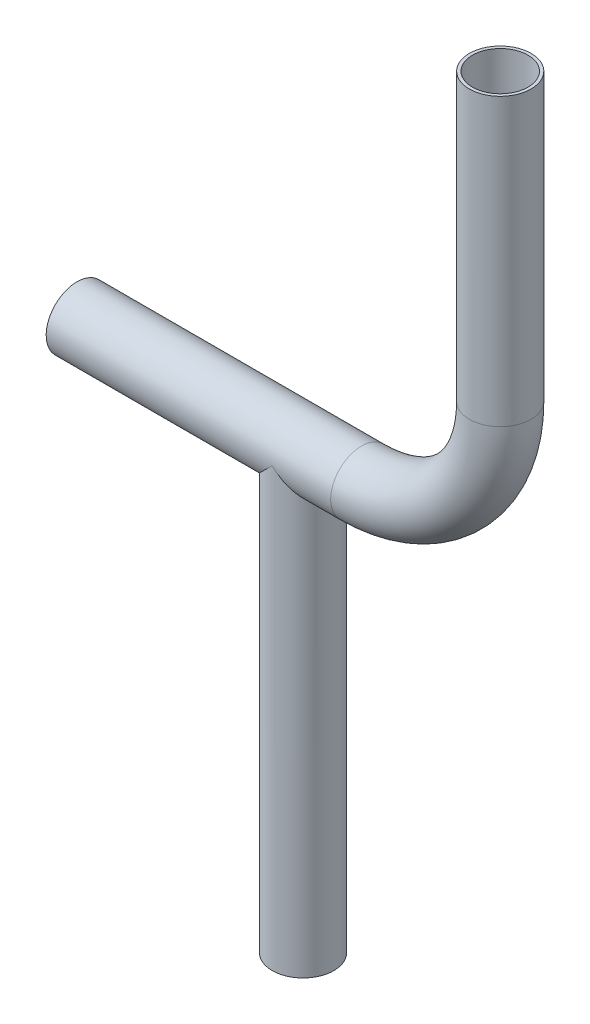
ISO-10303-21;
HEADER;
FILE_DESCRIPTION(('STEP AP214'),'2;1');
FILE_NAME('part.step','',(''),(''),'','','');
FILE_SCHEMA(('AUTOMOTIVE_DESIGN { 1 0 10303 214 1 1 1 1 }'));
ENDSEC;
DATA;
#1=APPLICATION_CONTEXT('core data for automotive mechanical design processes');
#2=APPLICATION_PROTOCOL_DEFINITION('international standard','automotive_design',2000,#1);
#3=PRODUCT_CONTEXT('',#1,'mechanical');
#4=PRODUCT('Part','Part','',(#3));
#5=PRODUCT_RELATED_PRODUCT_CATEGORY('part','',(#4));
#6=PRODUCT_DEFINITION_FORMATION('','',#4);
#7=PRODUCT_DEFINITION_CONTEXT('part definition',#1,'design');
#8=PRODUCT_DEFINITION('design','',#6,#7);
#9=PRODUCT_DEFINITION_SHAPE('','',#8);
#10=(LENGTH_UNIT() NAMED_UNIT(*) SI_UNIT(.MILLI.,.METRE.));
#11=(NAMED_UNIT(*) PLANE_ANGLE_UNIT() SI_UNIT($,.RADIAN.));
#12=(NAMED_UNIT(*) SI_UNIT($,.STERADIAN.) SOLID_ANGLE_UNIT());
#13=UNCERTAINTY_MEASURE_WITH_UNIT(LENGTH_MEASURE(1.E-05),#10,'distance_accuracy_value','');
#14=(GEOMETRIC_REPRESENTATION_CONTEXT(3) GLOBAL_UNCERTAINTY_ASSIGNED_CONTEXT((#13)) GLOBAL_UNIT_ASSIGNED_CONTEXT((#10,
#11,#12)) REPRESENTATION_CONTEXT('',''));
#15=CARTESIAN_POINT('',(0.,0.,0.));
#16=DIRECTION('',(0.,0.,1.));
#17=DIRECTION('',(1.,0.,0.));
#18=AXIS2_PLACEMENT_3D('',#15,#16,#17);
#19=CARTESIAN_POINT('',(56.8804723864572,425.366292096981,0.));
#20=DIRECTION('',(-1.,0.,0.));
#21=DIRECTION('',(0.,0.,1.));
#22=AXIS2_PLACEMENT_3D('',#19,#20,#21);
#23=CYLINDRICAL_SURFACE('',#22,30.);
#24=CARTESIAN_POINT('',(56.8804723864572,425.366292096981,0.));
#25=DIRECTION('',(1.,0.,0.));
#26=DIRECTION('',(0.,0.,-1.));
#27=AXIS2_PLACEMENT_3D('',#24,#25,#26);
#28=CIRCLE('',#27,30.);
#29=CARTESIAN_POINT('',(56.8804723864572,395.366292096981,0.));
#30=VERTEX_POINT('',#29);
#31=EDGE_CURVE('E77',#30,#30,#28,.T.);
#32=ORIENTED_EDGE('',*,*,#31,.F.);
#33=EDGE_LOOP('',(#32));
#34=FACE_BOUND('',#33,.T.);
#35=CARTESIAN_POINT('',(-219.813416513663,425.366292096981,0.));
#36=DIRECTION('',(1.,0.,0.));
#37=DIRECTION('',(0.,0.,-1.));
#38=AXIS2_PLACEMENT_3D('',#35,#36,#37);
#39=CIRCLE('',#38,30.);
#40=CARTESIAN_POINT('',(-219.813416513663,425.366292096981,-30.));
#41=VERTEX_POINT('',#40);
#42=EDGE_CURVE('E70',#41,#41,#39,.T.);
#43=ORIENTED_EDGE('',*,*,#42,.T.);
#44=EDGE_LOOP('',(#43));
#45=FACE_BOUND('',#44,.T.);
#46=CARTESIAN_POINT('',(0.,425.366292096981,0.));
#47=DIRECTION('',(-0.707106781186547,-0.707106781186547,0.));
#48=DIRECTION('',(0.707106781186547,-0.707106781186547,0.));
#49=AXIS2_PLACEMENT_3D('',#46,#47,#48);
#50=ELLIPSE('',#49,42.4264068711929,30.);
#51=CARTESIAN_POINT('',(0.,425.366292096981,30.));
#52=VERTEX_POINT('',#51);
#53=CARTESIAN_POINT('',(0.,425.366292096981,-30.));
#54=VERTEX_POINT('',#53);
#55=EDGE_CURVE('E62',#52,#54,#50,.F.);
#56=ORIENTED_EDGE('',*,*,#55,.T.);
#57=CARTESIAN_POINT('',(0.,425.366292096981,0.));
#58=DIRECTION('',(0.707106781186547,-0.707106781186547,0.));
#59=DIRECTION('',(-0.707106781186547,-0.707106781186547,0.));
#60=AXIS2_PLACEMENT_3D('',#57,#58,#59);
#61=ELLIPSE('',#60,42.4264068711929,30.);
#62=EDGE_CURVE('E60',#54,#52,#61,.F.);
#63=ORIENTED_EDGE('',*,*,#62,.T.);
#64=EDGE_LOOP('',(#56,#63));
#65=FACE_BOUND('',#64,.T.);
#66=ADVANCED_FACE('F46',(#34,#45,#65),#23,.T.);
#67=CARTESIAN_POINT('',(191.786393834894,560.272213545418,0.));
#68=DIRECTION('',(0.,1.,0.));
#69=DIRECTION('',(-1.,0.,0.));
#70=AXIS2_PLACEMENT_3D('',#67,#68,#69);
#71=CYLINDRICAL_SURFACE('',#70,30.);
#72=CARTESIAN_POINT('',(191.786393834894,560.272213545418,0.));
#73=DIRECTION('',(0.,1.,0.));
#74=DIRECTION('',(0.,0.,-1.));
#75=AXIS2_PLACEMENT_3D('',#72,#73,#74);
#76=CIRCLE('',#75,30.);
#77=CARTESIAN_POINT('',(221.786393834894,560.272213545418,0.));
#78=VERTEX_POINT('',#77);
#79=EDGE_CURVE('E85',#78,#78,#76,.T.);
#80=ORIENTED_EDGE('',*,*,#79,.T.);
#81=EDGE_LOOP('',(#80));
#82=FACE_BOUND('',#81,.T.);
#83=CARTESIAN_POINT('',(191.786393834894,838.539438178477,0.));
#84=DIRECTION('',(0.,1.,0.));
#85=DIRECTION('',(0.,0.,-1.));
#86=AXIS2_PLACEMENT_3D('',#83,#84,#85);
#87=CIRCLE('',#86,30.);
#88=CARTESIAN_POINT('',(191.786393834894,838.539438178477,-30.));
#89=VERTEX_POINT('',#88);
#90=EDGE_CURVE('E13',#89,#89,#87,.T.);
#91=ORIENTED_EDGE('',*,*,#90,.F.);
#92=EDGE_LOOP('',(#91));
#93=FACE_BOUND('',#92,.T.);
#94=ADVANCED_FACE('F48',(#82,#93),#71,.T.);
#95=CARTESIAN_POINT('',(191.786393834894,560.272213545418,0.));
#96=DIRECTION('',(0.,1.,0.));
#97=DIRECTION('',(-1.,0.,0.));
#98=AXIS2_PLACEMENT_3D('',#95,#96,#97);
#99=CYLINDRICAL_SURFACE('',#98,27.);
#100=CARTESIAN_POINT('',(191.786393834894,560.272213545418,0.));
#101=DIRECTION('',(0.,1.,0.));
#102=DIRECTION('',(0.,0.,-1.));
#103=AXIS2_PLACEMENT_3D('',#100,#101,#102);
#104=CIRCLE('',#103,27.);
#105=CARTESIAN_POINT('',(218.786393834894,560.272213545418,0.));
#106=VERTEX_POINT('',#105);
#107=EDGE_CURVE('E79',#106,#106,#104,.T.);
#108=ORIENTED_EDGE('',*,*,#107,.F.);
#109=EDGE_LOOP('',(#108));
#110=FACE_BOUND('',#109,.T.);
#111=CARTESIAN_POINT('',(191.786393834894,838.539438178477,0.));
#112=DIRECTION('',(0.,1.,0.));
#113=DIRECTION('',(0.,0.,-1.));
#114=AXIS2_PLACEMENT_3D('',#111,#112,#113);
#115=CIRCLE('',#114,27.);
#116=CARTESIAN_POINT('',(191.786393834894,838.539438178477,-27.));
#117=VERTEX_POINT('',#116);
#118=EDGE_CURVE('E54',#117,#117,#115,.T.);
#119=ORIENTED_EDGE('',*,*,#118,.T.);
#120=EDGE_LOOP('',(#119));
#121=FACE_BOUND('',#120,.T.);
#122=ADVANCED_FACE('F90',(#110,#121),#99,.F.);
#123=CARTESIAN_POINT('',(56.8804723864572,560.272213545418,0.));
#124=DIRECTION('',(0.,0.,1.));
#125=DIRECTION('',(1.,0.,0.));
#126=AXIS2_PLACEMENT_3D('',#123,#124,#125);
#127=TOROIDAL_SURFACE('',#126,134.905921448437,30.);
#128=CARTESIAN_POINT('',(56.8804723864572,560.272213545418,0.));
#129=DIRECTION('',(0.,0.,1.));
#130=DIRECTION('',(1.,0.,0.));
#131=AXIS2_PLACEMENT_3D('',#128,#129,#130);
#132=CIRCLE('',#131,164.905921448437);
#133=EDGE_CURVE('',#30,#78,#132,.T.);
#134=ORIENTED_EDGE('',*,*,#31,.T.);
#135=ORIENTED_EDGE('',*,*,#79,.F.);
#136=ORIENTED_EDGE('',*,*,#133,.T.);
#137=ORIENTED_EDGE('',*,*,#133,.F.);
#138=EDGE_LOOP('',(#134,#136,#135,#137));
#139=FACE_BOUND('',#138,.T.);
#140=ADVANCED_FACE('F106',(#139),#127,.T.);
#141=CARTESIAN_POINT('',(56.8804723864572,560.272213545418,0.));
#142=DIRECTION('',(0.,0.,1.));
#143=DIRECTION('',(1.,0.,0.));
#144=AXIS2_PLACEMENT_3D('',#141,#142,#143);
#145=TOROIDAL_SURFACE('',#144,134.905921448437,27.);
#146=CARTESIAN_POINT('',(56.8804723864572,425.366292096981,0.));
#147=DIRECTION('',(1.,0.,0.));
#148=DIRECTION('',(0.,0.,-1.));
#149=AXIS2_PLACEMENT_3D('',#146,#147,#148);
#150=CIRCLE('',#149,27.);
#151=CARTESIAN_POINT('',(56.8804723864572,398.366292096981,0.));
#152=VERTEX_POINT('',#151);
#153=EDGE_CURVE('E74',#152,#152,#150,.T.);
#154=CARTESIAN_POINT('',(56.8804723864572,560.272213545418,0.));
#155=DIRECTION('',(0.,0.,1.));
#156=DIRECTION('',(1.,0.,0.));
#157=AXIS2_PLACEMENT_3D('',#154,#155,#156);
#158=CIRCLE('',#157,161.905921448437);
#159=EDGE_CURVE('',#152,#106,#158,.T.);
#160=ORIENTED_EDGE('',*,*,#153,.F.);
#161=ORIENTED_EDGE('',*,*,#107,.T.);
#162=ORIENTED_EDGE('',*,*,#159,.T.);
#163=ORIENTED_EDGE('',*,*,#159,.F.);
#164=EDGE_LOOP('',(#160,#162,#161,#163));
#165=FACE_BOUND('',#164,.T.);
#166=ADVANCED_FACE('F114',(#165),#145,.F.);
#167=CARTESIAN_POINT('',(56.8804723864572,425.366292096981,0.));
#168=DIRECTION('',(-1.,0.,0.));
#169=DIRECTION('',(0.,0.,1.));
#170=AXIS2_PLACEMENT_3D('',#167,#168,#169);
#171=CYLINDRICAL_SURFACE('',#170,27.);
#172=ORIENTED_EDGE('',*,*,#153,.T.);
#173=EDGE_LOOP('',(#172));
#174=FACE_BOUND('',#173,.T.);
#175=CARTESIAN_POINT('',(-219.813416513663,425.366292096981,0.));
#176=DIRECTION('',(1.,0.,0.));
#177=DIRECTION('',(0.,0.,-1.));
#178=AXIS2_PLACEMENT_3D('',#175,#176,#177);
#179=CIRCLE('',#178,27.);
#180=CARTESIAN_POINT('',(-219.813416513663,425.366292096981,-27.));
#181=VERTEX_POINT('',#180);
#182=EDGE_CURVE('E67',#181,#181,#179,.T.);
#183=ORIENTED_EDGE('',*,*,#182,.F.);
#184=EDGE_LOOP('',(#183));
#185=FACE_BOUND('',#184,.T.);
#186=ADVANCED_FACE('F96',(#174,#185),#171,.F.);
#187=CARTESIAN_POINT('',(191.786393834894,838.539438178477,0.));
#188=DIRECTION('',(0.,1.,0.));
#189=DIRECTION('',(0.,0.,-1.));
#190=AXIS2_PLACEMENT_3D('',#187,#188,#189);
#191=PLANE('',#190);
#192=ORIENTED_EDGE('',*,*,#118,.F.);
#193=EDGE_LOOP('',(#192));
#194=FACE_BOUND('',#193,.T.);
#195=ORIENTED_EDGE('',*,*,#90,.T.);
#196=EDGE_LOOP('',(#195));
#197=FACE_BOUND('',#196,.T.);
#198=ADVANCED_FACE('F92',(#194,#197),#191,.T.);
#199=CARTESIAN_POINT('',(-219.813416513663,425.366292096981,0.));
#200=DIRECTION('',(1.,0.,0.));
#201=DIRECTION('',(0.,0.,-1.));
#202=AXIS2_PLACEMENT_3D('',#199,#200,#201);
#203=PLANE('',#202);
#204=ORIENTED_EDGE('',*,*,#182,.T.);
#205=EDGE_LOOP('',(#204));
#206=FACE_BOUND('',#205,.T.);
#207=ORIENTED_EDGE('',*,*,#42,.F.);
#208=EDGE_LOOP('',(#207));
#209=FACE_BOUND('',#208,.T.);
#210=ADVANCED_FACE('F95',(#206,#209),#203,.F.);
#211=CARTESIAN_POINT('',(-3.33066907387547E-13,838.540438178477,0.));
#212=DIRECTION('',(0.,-1.,0.));
#213=DIRECTION('',(0.,0.,-1.));
#214=AXIS2_PLACEMENT_3D('',#211,#212,#213);
#215=CYLINDRICAL_SURFACE('',#214,30.);
#216=CARTESIAN_POINT('',(0.,0.,0.));
#217=DIRECTION('',(0.,1.,0.));
#218=DIRECTION('',(0.,0.,1.));
#219=AXIS2_PLACEMENT_3D('',#216,#217,#218);
#220=CIRCLE('',#219,30.);
#221=CARTESIAN_POINT('',(0.,0.,30.));
#222=VERTEX_POINT('',#221);
#223=EDGE_CURVE('E143',#222,#222,#220,.T.);
#224=ORIENTED_EDGE('',*,*,#223,.T.);
#225=EDGE_LOOP('',(#224));
#226=FACE_BOUND('',#225,.T.);
#227=ORIENTED_EDGE('',*,*,#55,.F.);
#228=ORIENTED_EDGE('',*,*,#62,.F.);
#229=EDGE_LOOP('',(#227,#228));
#230=FACE_BOUND('',#229,.T.);
#231=ADVANCED_FACE('F66',(#226,#230),#215,.T.);
#232=CARTESIAN_POINT('',(0.,0.,0.));
#233=DIRECTION('',(0.,1.,0.));
#234=DIRECTION('',(0.,0.,1.));
#235=AXIS2_PLACEMENT_3D('',#232,#233,#234);
#236=PLANE('',#235);
#237=ORIENTED_EDGE('',*,*,#223,.F.);
#238=EDGE_LOOP('',(#237));
#239=FACE_BOUND('',#238,.T.);
#240=CARTESIAN_POINT('',(0.,0.,0.));
#241=DIRECTION('',(0.,1.,0.));
#242=DIRECTION('',(0.,0.,1.));
#243=AXIS2_PLACEMENT_3D('',#240,#241,#242);
#244=CIRCLE('',#243,27.);
#245=CARTESIAN_POINT('',(0.,0.,27.));
#246=VERTEX_POINT('',#245);
#247=EDGE_CURVE('E140',#246,#246,#244,.T.);
#248=ORIENTED_EDGE('',*,*,#247,.T.);
#249=EDGE_LOOP('',(#248));
#250=FACE_BOUND('',#249,.T.);
#251=ADVANCED_FACE('F148',(#239,#250),#236,.F.);
#252=CARTESIAN_POINT('',(-3.33066907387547E-13,838.540438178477,0.));
#253=DIRECTION('',(0.,-1.,0.));
#254=DIRECTION('',(0.,0.,-1.));
#255=AXIS2_PLACEMENT_3D('',#252,#253,#254);
#256=CYLINDRICAL_SURFACE('',#255,27.);
#257=ORIENTED_EDGE('',*,*,#247,.F.);
#258=EDGE_LOOP('',(#257));
#259=FACE_BOUND('',#258,.T.);
#260=CARTESIAN_POINT('',(0.,412.289595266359,-27.));
#261=CARTESIAN_POINT('',(-0.404659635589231,412.289585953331,-26.9999973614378));
#262=CARTESIAN_POINT('',(-0.809365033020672,412.27069799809,-26.9908725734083));
#263=CARTESIAN_POINT('',(-1.61474930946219,412.196389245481,-26.9546895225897));
#264=CARTESIAN_POINT('',(-2.01542562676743,412.1409465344,-26.9276205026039));
#265=CARTESIAN_POINT('',(-2.81035336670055,411.9967482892,-26.8563163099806));
#266=CARTESIAN_POINT('',(-3.20458125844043,411.907890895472,-26.8120286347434));
#267=CARTESIAN_POINT('',(-3.98339558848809,411.70151112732,-26.7074350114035));
#268=CARTESIAN_POINT('',(-4.36797699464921,411.5839741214,-26.647120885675));
#269=CARTESIAN_POINT('',(-5.02795722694,411.358772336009,-26.5292494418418));
#270=CARTESIAN_POINT('',(-5.30581371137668,411.256447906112,-26.4750311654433));
#271=CARTESIAN_POINT('',(-5.8554262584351,411.04071335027,-26.3589230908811));
#272=CARTESIAN_POINT('',(-6.12718420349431,410.927306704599,-26.2970356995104));
#273=CARTESIAN_POINT('',(-6.93392369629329,410.572870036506,-26.1003340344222));
#274=CARTESIAN_POINT('',(-7.46007002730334,410.317729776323,-25.9545348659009));
#275=CARTESIAN_POINT('',(-8.49179464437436,409.780527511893,-25.6355612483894));
#276=CARTESIAN_POINT('',(-8.99730097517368,409.498381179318,-25.4622998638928));
#277=CARTESIAN_POINT('',(-9.98809021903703,408.916327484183,-25.0901968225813));
#278=CARTESIAN_POINT('',(-10.4733758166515,408.616422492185,-24.8913585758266));
#279=CARTESIAN_POINT('',(-11.3567603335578,408.049286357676,-24.4994385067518));
#280=CARTESIAN_POINT('',(-11.7573311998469,407.783589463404,-24.3096704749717));
#281=CARTESIAN_POINT('',(-12.5458713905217,407.246814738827,-23.9122575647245));
#282=CARTESIAN_POINT('',(-12.9338392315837,406.975736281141,-23.704610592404));
#283=CARTESIAN_POINT('',(-13.6978988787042,406.430590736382,-23.271452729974));
#284=CARTESIAN_POINT('',(-14.0739838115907,406.156522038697,-23.0459317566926));
#285=CARTESIAN_POINT('',(-14.8143461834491,405.607669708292,-22.5771368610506));
#286=CARTESIAN_POINT('',(-15.178624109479,405.33288610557,-22.3338636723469));
#287=CARTESIAN_POINT('',(-15.8950606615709,404.784751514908,-21.829765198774));
#288=CARTESIAN_POINT('',(-16.2472332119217,404.511399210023,-21.5689611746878));
#289=CARTESIAN_POINT('',(-16.9397834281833,403.967450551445,-21.0294182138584));
#290=CARTESIAN_POINT('',(-17.2801598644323,403.696854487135,-20.7506774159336));
#291=CARTESIAN_POINT('',(-18.2828191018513,402.891815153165,-19.8875910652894));
#292=CARTESIAN_POINT('',(-18.9271838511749,402.363694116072,-19.2759941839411));
#293=CARTESIAN_POINT('',(-20.0129109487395,401.461282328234,-18.1367895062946));
#294=CARTESIAN_POINT('',(-20.4655924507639,401.080759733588,-17.6248116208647));
#295=CARTESIAN_POINT('',(-21.3376469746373,400.341472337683,-16.5583592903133));
#296=CARTESIAN_POINT('',(-21.7570205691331,399.982707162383,-16.0038855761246));
#297=CARTESIAN_POINT('',(-22.5581166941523,399.292794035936,-14.8533439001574));
#298=CARTESIAN_POINT('',(-22.9398908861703,398.961608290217,-14.2573349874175));
#299=CARTESIAN_POINT('',(-23.4812113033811,398.489545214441,-13.3326775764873));
#300=CARTESIAN_POINT('',(-23.6564203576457,398.33631682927,-13.0193667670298));
#301=CARTESIAN_POINT('',(-23.9958605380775,398.038748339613,-12.3826041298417));
#302=CARTESIAN_POINT('',(-24.1600888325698,397.894410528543,-12.0591497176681));
#303=CARTESIAN_POINT('',(-24.5731555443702,397.530606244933,-11.2028344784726));
#304=CARTESIAN_POINT('',(-24.8127544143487,397.318794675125,-10.6621812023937));
#305=CARTESIAN_POINT('',(-25.2588323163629,396.923402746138,-9.5575171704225));
#306=CARTESIAN_POINT('',(-25.4653184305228,396.739816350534,-8.99351144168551));
#307=CARTESIAN_POINT('',(-25.8423311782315,396.403924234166,-7.84469190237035));
#308=CARTESIAN_POINT('',(-26.0128697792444,396.251608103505,-7.25988509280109));
#309=CARTESIAN_POINT('',(-26.3153687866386,395.981022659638,-6.07261086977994));
#310=CARTESIAN_POINT('',(-26.4473287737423,395.862753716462,-5.47014326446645));
#311=CARTESIAN_POINT('',(-26.6710170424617,395.662072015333,-4.24795074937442));
#312=CARTESIAN_POINT('',(-26.7624947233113,395.579882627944,-3.62814292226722));
#313=CARTESIAN_POINT('',(-26.9022534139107,395.45424938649,-2.37975249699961));
#314=CARTESIAN_POINT('',(-26.9505343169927,395.410805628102,-1.75116987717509));
#315=CARTESIAN_POINT('',(-27.0029031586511,395.363681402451,-0.490834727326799));
#316=CARTESIAN_POINT('',(-27.0070024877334,395.359990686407,0.140916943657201));
#317=CARTESIAN_POINT('',(-26.9709477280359,395.392437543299,1.4020965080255));
#318=CARTESIAN_POINT('',(-26.9307966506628,395.428572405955,2.03152455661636));
#319=CARTESIAN_POINT('',(-26.8131136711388,395.534388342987,3.22164700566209));
#320=CARTESIAN_POINT('',(-26.7395997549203,395.600462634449,3.78306936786));
#321=CARTESIAN_POINT('',(-26.5584002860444,395.76313295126,4.89582408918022));
#322=CARTESIAN_POINT('',(-26.4507174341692,395.859726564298,5.44715724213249));
#323=CARTESIAN_POINT('',(-26.2027799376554,396.08178019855,6.53654896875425));
#324=CARTESIAN_POINT('',(-26.0625214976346,396.207243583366,7.07460598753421));
#325=CARTESIAN_POINT('',(-25.751356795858,396.485027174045,8.13466803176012));
#326=CARTESIAN_POINT('',(-25.5804486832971,396.637349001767,8.65667208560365));
#327=CARTESIAN_POINT('',(-25.199887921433,396.975688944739,9.71064441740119));
#328=CARTESIAN_POINT('',(-24.9886210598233,397.163099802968,10.2415810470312));
#329=CARTESIAN_POINT('',(-24.5368323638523,397.562605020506,11.2811851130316));
#330=CARTESIAN_POINT('',(-24.2963103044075,397.774699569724,11.7898523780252));
#331=CARTESIAN_POINT('',(-23.7884537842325,398.220835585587,12.7836183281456));
#332=CARTESIAN_POINT('',(-23.5211172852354,398.454878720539,13.2687152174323));
#333=CARTESIAN_POINT('',(-22.9618843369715,398.942262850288,14.2145626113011));
#334=CARTESIAN_POINT('',(-22.6699827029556,399.195607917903,14.6753079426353));
#335=CARTESIAN_POINT('',(-22.1356139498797,399.656920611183,15.4656100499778));
#336=CARTESIAN_POINT('',(-21.8978218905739,399.861416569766,15.8003835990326));
#337=CARTESIAN_POINT('',(-21.4100599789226,400.278948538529,16.4552727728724));
#338=CARTESIAN_POINT('',(-21.1600921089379,400.491983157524,16.7753907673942));
#339=CARTESIAN_POINT('',(-20.3927350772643,401.142548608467,17.7141163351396));
#340=CARTESIAN_POINT('',(-19.8580238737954,401.591427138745,18.310902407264));
#341=CARTESIAN_POINT('',(-18.7455541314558,402.512450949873,19.4483848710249));
#342=CARTESIAN_POINT('',(-18.1676472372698,402.984674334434,19.9888711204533));
#343=CARTESIAN_POINT('',(-16.9735697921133,403.942600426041,21.0122857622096));
#344=CARTESIAN_POINT('',(-16.3574078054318,404.428300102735,21.4952269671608));
#345=CARTESIAN_POINT('',(-15.3978264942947,405.166040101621,22.1825747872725));
#346=CARTESIAN_POINT('',(-15.0679784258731,405.416487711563,22.4079352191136));
#347=CARTESIAN_POINT('',(-14.3985164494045,405.917183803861,22.8438678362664));
#348=CARTESIAN_POINT('',(-14.0589033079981,406.167432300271,23.0544411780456));
#349=CARTESIAN_POINT('',(-13.3694737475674,406.666393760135,23.4609770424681));
#350=CARTESIAN_POINT('',(-13.0196499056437,406.915105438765,23.656928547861));
#351=CARTESIAN_POINT('',(-12.3097167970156,407.409006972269,24.0339844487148));
#352=CARTESIAN_POINT('',(-11.9496085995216,407.654197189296,24.2150903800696));
#353=CARTESIAN_POINT('',(-11.2199076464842,408.138059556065,24.5616819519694));
#354=CARTESIAN_POINT('',(-10.850355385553,408.376752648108,24.7272234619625));
#355=CARTESIAN_POINT('',(-10.0997273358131,408.846042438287,25.0431897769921));
#356=CARTESIAN_POINT('',(-9.7186503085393,409.076638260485,25.1936129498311));
#357=CARTESIAN_POINT('',(-8.94463442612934,409.526236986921,25.4786852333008));
#358=CARTESIAN_POINT('',(-8.55171133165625,409.745254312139,25.6133542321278));
#359=CARTESIAN_POINT('',(-7.75269062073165,410.167960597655,25.8664134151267));
#360=CARTESIAN_POINT('',(-7.34659753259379,410.371654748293,25.9848091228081));
#361=CARTESIAN_POINT('',(-6.5843294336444,410.728725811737,26.1873451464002));
#362=CARTESIAN_POINT('',(-6.23017716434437,410.885007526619,26.2739504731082));
#363=CARTESIAN_POINT('',(-5.51145118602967,411.179374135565,26.4340580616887));
#364=CARTESIAN_POINT('',(-5.14687834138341,411.317460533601,26.5075614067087));
#365=CARTESIAN_POINT('',(-4.40831988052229,411.570881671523,26.6403283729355));
#366=CARTESIAN_POINT('',(-4.03435977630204,411.686271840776,26.6996267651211));
#367=CARTESIAN_POINT('',(-3.27703163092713,411.890163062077,26.8031166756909));
#368=CARTESIAN_POINT('',(-2.89366372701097,411.97866450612,26.8473084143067));
#369=CARTESIAN_POINT('',(-2.11336625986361,412.125545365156,26.9200579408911));
#370=CARTESIAN_POINT('',(-1.7163183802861,412.183432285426,26.9483605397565));
#371=CARTESIAN_POINT('',(-0.917766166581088,412.263444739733,26.9873567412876));
#372=CARTESIAN_POINT('',(-0.516262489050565,412.285575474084,26.9980529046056));
#373=CARTESIAN_POINT('',(0.287098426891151,412.292611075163,27.0014608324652));
#374=CARTESIAN_POINT('',(0.688955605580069,412.277521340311,26.994175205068));
#375=CARTESIAN_POINT('',(1.48894333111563,412.211144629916,26.9618879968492));
#376=CARTESIAN_POINT('',(1.88707328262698,412.159851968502,26.9368836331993));
#377=CARTESIAN_POINT('',(2.7102551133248,412.018367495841,26.867072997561));
#378=CARTESIAN_POINT('',(3.13465878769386,411.925196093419,26.8207416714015));
#379=CARTESIAN_POINT('',(3.97219493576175,411.70559167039,26.7095547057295));
#380=CARTESIAN_POINT('',(4.38532507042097,411.579151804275,26.6446952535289));
#381=CARTESIAN_POINT('',(5.20041934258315,411.298693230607,26.497693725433));
#382=CARTESIAN_POINT('',(5.60234102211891,411.144582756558,26.4154939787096));
#383=CARTESIAN_POINT('',(6.39363589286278,410.814689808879,26.2352091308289));
#384=CARTESIAN_POINT('',(6.78300335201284,410.638897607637,26.1371168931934));
#385=CARTESIAN_POINT('',(7.51880590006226,410.285281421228,25.9345574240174));
#386=CARTESIAN_POINT('',(7.8661820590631,410.108747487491,25.8312297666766));
#387=CARTESIAN_POINT('',(8.55111171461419,409.744595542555,25.612647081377));
#388=CARTESIAN_POINT('',(8.88866698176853,409.556979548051,25.4973942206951));
#389=CARTESIAN_POINT('',(9.55489830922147,409.173025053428,25.2552894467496));
#390=CARTESIAN_POINT('',(9.88356708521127,408.976679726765,25.128428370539));
#391=CARTESIAN_POINT('',(10.5323273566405,408.577466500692,24.8634835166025));
#392=CARTESIAN_POINT('',(10.8524178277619,408.37459782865,24.725398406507));
#393=CARTESIAN_POINT('',(11.8013732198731,407.758343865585,24.2942638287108));
#394=CARTESIAN_POINT('',(12.4181315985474,407.337776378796,23.9846243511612));
#395=CARTESIAN_POINT('',(13.6216269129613,406.488588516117,23.3221508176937));
#396=CARTESIAN_POINT('',(14.2083730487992,406.059970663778,22.9693301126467));
#397=CARTESIAN_POINT('',(15.4159893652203,405.155514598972,22.1793437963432));
#398=CARTESIAN_POINT('',(16.0335710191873,404.679639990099,21.7371735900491));
#399=CARTESIAN_POINT('',(17.2334241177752,403.736363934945,20.7987763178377));
#400=CARTESIAN_POINT('',(17.8156889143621,403.26896409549,20.3025391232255));
#401=CARTESIAN_POINT('',(18.9419203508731,402.351295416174,19.2560018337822));
#402=CARTESIAN_POINT('',(19.485943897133,401.901001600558,18.7057851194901));
#403=CARTESIAN_POINT('',(20.5330123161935,401.024503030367,17.5500163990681));
#404=CARTESIAN_POINT('',(21.0360683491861,400.598291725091,16.9444795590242));
#405=CARTESIAN_POINT('',(21.8978407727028,399.861855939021,15.8077110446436));
#406=CARTESIAN_POINT('',(22.2650114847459,399.545760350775,15.2866786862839));
#407=CARTESIAN_POINT('',(22.9672271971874,398.937848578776,14.2098394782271));
#408=CARTESIAN_POINT('',(23.3022735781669,398.646031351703,13.6540341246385));
#409=CARTESIAN_POINT('',(23.9363790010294,398.091272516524,12.5091022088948));
#410=CARTESIAN_POINT('',(24.235466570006,397.828308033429,11.9200026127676));
#411=CARTESIAN_POINT('',(24.7939689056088,397.335530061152,10.709943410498));
#412=CARTESIAN_POINT('',(25.0533899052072,397.105711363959,10.0889888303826));
#413=CARTESIAN_POINT('',(25.4914645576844,396.716574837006,8.91703100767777));
#414=CARTESIAN_POINT('',(25.6764046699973,396.551851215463,8.37016763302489));
#415=CARTESIAN_POINT('',(26.0125859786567,396.251882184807,7.2582758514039));
#416=CARTESIAN_POINT('',(26.1638304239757,396.116633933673,6.6932492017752));
#417=CARTESIAN_POINT('',(26.430294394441,395.878041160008,5.54840243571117));
#418=CARTESIAN_POINT('',(26.5455304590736,395.774681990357,4.96858924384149));
#419=CARTESIAN_POINT('',(26.7381651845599,395.601754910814,3.79769723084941));
#420=CARTESIAN_POINT('',(26.8155634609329,395.532187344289,3.20661829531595));
#421=CARTESIAN_POINT('',(26.9313511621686,395.428071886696,2.01537108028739));
#422=CARTESIAN_POINT('',(26.9695971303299,395.393652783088,1.41517749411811));
#423=CARTESIAN_POINT('',(27.0058638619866,395.361015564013,0.212584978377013));
#424=CARTESIAN_POINT('',(27.0038845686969,395.362797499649,-0.389813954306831));
#425=CARTESIAN_POINT('',(26.9597382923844,395.402524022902,-1.59195488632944));
#426=CARTESIAN_POINT('',(26.9175695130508,395.440470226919,-2.19169676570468));
#427=CARTESIAN_POINT('',(26.7938286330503,395.551723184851,-3.38375919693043));
#428=CARTESIAN_POINT('',(26.7122572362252,395.625029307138,-3.97607988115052));
#429=CARTESIAN_POINT('',(26.5168412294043,395.800414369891,-5.11590491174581));
#430=CARTESIAN_POINT('',(26.4050726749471,395.900640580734,-5.66405467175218));
#431=CARTESIAN_POINT('',(26.1494094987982,396.129528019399,-6.74668275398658));
#432=CARTESIAN_POINT('',(26.0055170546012,396.258187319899,-7.28116200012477));
#433=CARTESIAN_POINT('',(25.6875235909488,396.541932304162,-8.33388039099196));
#434=CARTESIAN_POINT('',(25.5134191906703,396.697020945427,-8.85211771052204));
#435=CARTESIAN_POINT('',(25.1370510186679,397.031439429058,-9.87032517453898));
#436=CARTESIAN_POINT('',(24.9347817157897,397.210774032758,-10.370291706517));
#437=CARTESIAN_POINT('',(24.5730697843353,397.530504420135,-11.1936093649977));
#438=CARTESIAN_POINT('',(24.420594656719,397.665032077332,-11.5223475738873));
#439=CARTESIAN_POINT('',(24.1043042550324,397.943457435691,-12.1701446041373));
#440=CARTESIAN_POINT('',(23.9404913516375,398.087353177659,-12.4892054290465));
#441=CARTESIAN_POINT('',(23.4328328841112,398.532153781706,-13.431740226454));
#442=CARTESIAN_POINT('',(23.0728094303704,398.846134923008,-14.040471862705));
#443=CARTESIAN_POINT('',(22.3137910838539,399.503785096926,-15.2179713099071));
#444=CARTESIAN_POINT('',(21.914719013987,399.847512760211,-15.7866559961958));
#445=CARTESIAN_POINT('',(21.0822249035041,400.558764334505,-16.8823325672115));
#446=CARTESIAN_POINT('',(20.6488027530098,400.926288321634,-17.4093243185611));
#447=CARTESIAN_POINT('',(19.6138738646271,401.795073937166,-18.5762230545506));
#448=CARTESIAN_POINT('',(19.0014267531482,402.302930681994,-19.2015320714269));
#449=CARTESIAN_POINT('',(17.7286490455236,403.339760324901,-20.3825749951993));
#450=CARTESIAN_POINT('',(17.0682968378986,403.868742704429,-20.9382771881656));
#451=CARTESIAN_POINT('',(16.0443146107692,404.66906792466,-21.7201322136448));
#452=CARTESIAN_POINT('',(15.6974300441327,404.936971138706,-21.9721226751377));
#453=CARTESIAN_POINT('',(14.9924753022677,405.473531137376,-22.4590568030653));
#454=CARTESIAN_POINT('',(14.6344060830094,405.74218785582,-22.6940019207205));
#455=CARTESIAN_POINT('',(13.9071654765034,406.278365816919,-23.1467953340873));
#456=CARTESIAN_POINT('',(13.5380000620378,406.545887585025,-23.364652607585));
#457=CARTESIAN_POINT('',(12.7880184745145,407.077947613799,-23.7834199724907));
#458=CARTESIAN_POINT('',(12.4072012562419,407.342485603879,-23.98432853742));
#459=CARTESIAN_POINT('',(11.6014623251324,407.887769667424,-24.3849318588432));
#460=CARTESIAN_POINT('',(11.175494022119,408.168052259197,-24.5831588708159));
#461=CARTESIAN_POINT('',(10.3083515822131,408.71847423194,-24.9591904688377));
#462=CARTESIAN_POINT('',(9.86718062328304,408.988615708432,-25.1369992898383));
#463=CARTESIAN_POINT('',(8.96845495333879,409.513840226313,-25.4714864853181));
#464=CARTESIAN_POINT('',(8.51090920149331,409.768931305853,-25.6281761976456));
#465=CARTESIAN_POINT('',(7.57774208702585,410.257876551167,-25.9194260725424));
#466=CARTESIAN_POINT('',(7.10212529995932,410.49173604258,-26.0539917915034));
#467=CARTESIAN_POINT('',(6.25449857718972,410.874417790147,-26.2682476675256));
#468=CARTESIAN_POINT('',(5.88677791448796,411.029771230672,-26.3532023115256));
#469=CARTESIAN_POINT('',(5.14020391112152,411.319819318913,-26.5089360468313));
#470=CARTESIAN_POINT('',(4.76134962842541,411.454512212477,-26.5797139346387));
#471=CARTESIAN_POINT('',(3.99411619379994,411.698039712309,-26.7057608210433));
#472=CARTESIAN_POINT('',(3.60577006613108,411.806952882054,-26.7610770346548));
#473=CARTESIAN_POINT('',(2.81999069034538,411.994415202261,-26.8552413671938));
#474=CARTESIAN_POINT('',(2.42256375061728,412.072984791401,-26.8941005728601));
#475=CARTESIAN_POINT('',(1.68802241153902,412.185223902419,-26.9492609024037));
#476=CARTESIAN_POINT('',(1.35192146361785,412.224200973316,-26.9682457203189));
#477=CARTESIAN_POINT('',(0.677224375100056,412.276390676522,-26.9936164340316));
#478=CARTESIAN_POINT('',(0.338628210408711,412.289603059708,-27.0000022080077));
#479=CARTESIAN_POINT('',(0.,412.289595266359,-27.));
#480=B_SPLINE_CURVE_WITH_KNOTS('',3,(#260,#261,#262,#263,#264,#265,#266,#267,#268,#269,#270,
#271,#272,#273,#274,#275,#276,#277,#278,#279,#280,#281,#282,#283,#284,#285,#286,#287,#288,#289,
#290,#291,#292,#293,#294,#295,#296,#297,#298,#299,#300,#301,#302,#303,#304,#305,#306,#307,#308,
#309,#310,#311,#312,#313,#314,#315,#316,#317,#318,#319,#320,#321,#322,#323,#324,#325,#326,#327,
#328,#329,#330,#331,#332,#333,#334,#335,#336,#337,#338,#339,#340,#341,#342,#343,#344,#345,#346,
#347,#348,#349,#350,#351,#352,#353,#354,#355,#356,#357,#358,#359,#360,#361,#362,#363,#364,#365,
#366,#367,#368,#369,#370,#371,#372,#373,#374,#375,#376,#377,#378,#379,#380,#381,#382,#383,#384,
#385,#386,#387,#388,#389,#390,#391,#392,#393,#394,#395,#396,#397,#398,#399,#400,#401,#402,#403,
#404,#405,#406,#407,#408,#409,#410,#411,#412,#413,#414,#415,#416,#417,#418,#419,#420,#421,#422,
#423,#424,#425,#426,#427,#428,#429,#430,#431,#432,#433,#434,#435,#436,#437,#438,#439,#440,#441,
#442,#443,#444,#445,#446,#447,#448,#449,#450,#451,#452,#453,#454,#455,#456,#457,#458,#459,#460,
#461,#462,#463,#464,#465,#466,#467,#468,#469,#470,#471,#472,#473,#474,#475,#476,#477,#478,#479),
.UNSPECIFIED.,.T.,.F.,(4,2,2,2,2,2,2,2,2,2,2,2,2,2,2,2,2,2,2,2,2,2,2,2,2,2,2,2,2,2,2,2,2,2,2,2,
2,2,2,2,2,2,2,2,2,2,2,2,2,2,2,2,2,2,2,2,2,2,2,2,2,2,2,2,2,2,2,2,2,2,2,2,2,2,2,2,2,2,2,2,2,2,2,2,
2,2,2,2,2,2,2,2,2,2,2,2,2,2,2,2,2,2,2,2,2,2,2,2,2,4),(0.,1.21353654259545,2.42780123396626,
3.64579783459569,4.86441712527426,5.76710946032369,6.66951921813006,8.47530640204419,
10.2869286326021,12.0983095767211,13.6481632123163,15.1981986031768,16.7491147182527,
18.299966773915,19.8489708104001,21.3981358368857,24.4940792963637,26.8387973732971,
29.1834751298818,31.5248849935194,32.6954783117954,33.8663723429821,35.7488973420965,
37.6310191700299,39.5125134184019,41.3940281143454,43.2870325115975,45.18004158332,
47.0725626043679,48.9649548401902,50.6731875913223,52.3812853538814,54.0895822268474,
55.7979822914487,57.6003666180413,59.4027648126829,61.2053001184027,63.0082168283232,
64.3839392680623,65.759438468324,68.511213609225,71.2729172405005,74.0340048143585,
75.4482330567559,76.8623505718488,78.2775230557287,79.6925489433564,81.102284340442,
82.5121717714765,83.920259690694,85.327868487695,86.517230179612,87.7064935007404,
88.8928152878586,90.0791197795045,91.2839686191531,92.4886422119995,93.6931410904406,
94.8978291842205,96.2066666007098,97.515773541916,98.8293049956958,100.143427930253,
101.352314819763,102.560982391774,103.770612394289,104.980386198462,107.402812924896,
109.824492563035,112.511086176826,115.1981839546,117.881194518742,120.563471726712,
122.696125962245,124.828688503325,126.959547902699,129.090072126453,130.889257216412,
132.688268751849,134.486452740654,136.284655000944,138.089422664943,139.894192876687,
141.699043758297,143.503862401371,145.207047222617,146.910116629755,148.613376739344,
150.316971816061,151.476210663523,152.635207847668,154.953530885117,157.276532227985,
159.599541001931,162.631220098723,165.664275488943,167.180648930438,168.696893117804,
170.212335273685,171.727913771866,173.368535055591,175.008815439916,176.648211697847,
178.287195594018,179.510823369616,180.734554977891,181.954507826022,183.173637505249,
184.189142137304,185.204656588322),.UNSPECIFIED.);
#481=CARTESIAN_POINT('',(0.,412.289595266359,-27.));
#482=VERTEX_POINT('',#481);
#483=EDGE_CURVE('E64',#482,#482,#480,.T.);
#484=ORIENTED_EDGE('',*,*,#483,.T.);
#485=EDGE_LOOP('',(#484));
#486=FACE_BOUND('',#485,.T.);
#487=ADVANCED_FACE('F127',(#259,#486),#256,.F.);
#488=ORIENTED_EDGE('',*,*,#483,.F.);
#489=EDGE_LOOP('',(#488));
#490=FACE_BOUND('',#489,.T.);
#491=ADVANCED_FACE('F110',(#490),#23,.T.);
#492=CLOSED_SHELL('',(#66,#94,#122,#140,#166,#186,#198,#210,#231,#251,#487,#491));
#493=MANIFOLD_SOLID_BREP('B2',#492);
#494=ADVANCED_BREP_SHAPE_REPRESENTATION('',(#18,#493),#14);
#495=SHAPE_DEFINITION_REPRESENTATION(#9,#494);
ENDSEC;
END-ISO-10303-21;
